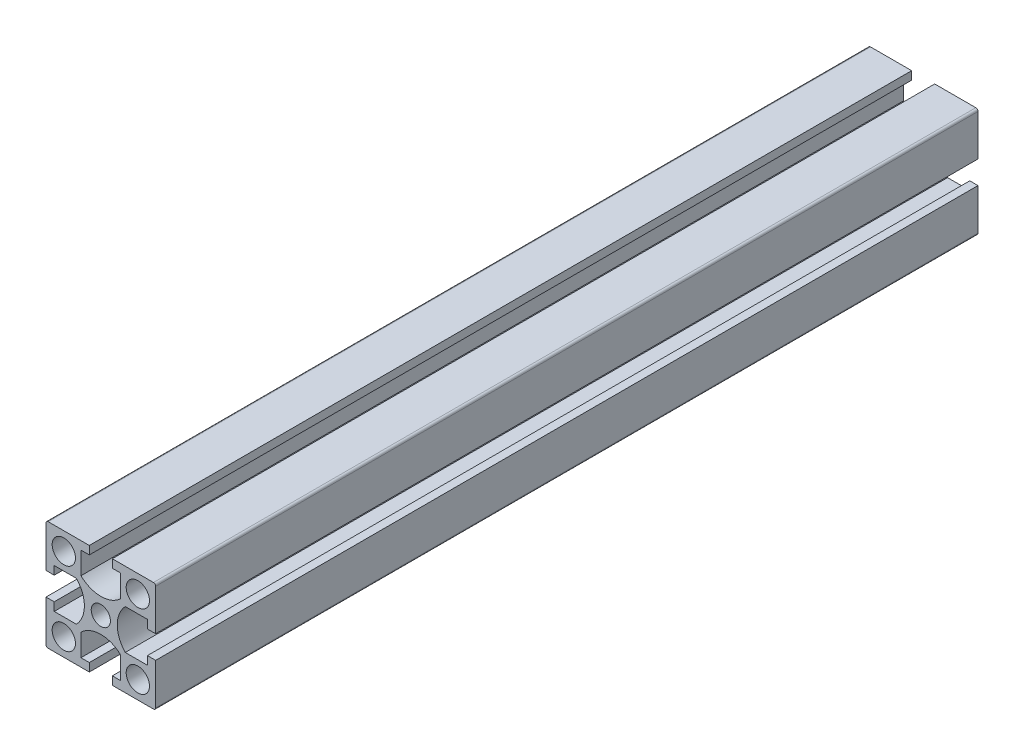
ISO-10303-21;
HEADER;
FILE_DESCRIPTION(('STEP AP214'),'2;1');
FILE_NAME('part.step','',(''),(''),'','','');
FILE_SCHEMA(('AUTOMOTIVE_DESIGN { 1 0 10303 214 1 1 1 1 }'));
ENDSEC;
DATA;
#1=APPLICATION_CONTEXT('core data for automotive mechanical design processes');
#2=APPLICATION_PROTOCOL_DEFINITION('international standard','automotive_design',2000,#1);
#3=PRODUCT_CONTEXT('',#1,'mechanical');
#4=PRODUCT('Part','Part','',(#3));
#5=PRODUCT_RELATED_PRODUCT_CATEGORY('part','',(#4));
#6=PRODUCT_DEFINITION_FORMATION('','',#4);
#7=PRODUCT_DEFINITION_CONTEXT('part definition',#1,'design');
#8=PRODUCT_DEFINITION('design','',#6,#7);
#9=PRODUCT_DEFINITION_SHAPE('','',#8);
#10=(LENGTH_UNIT() NAMED_UNIT(*) SI_UNIT(.MILLI.,.METRE.));
#11=(NAMED_UNIT(*) PLANE_ANGLE_UNIT() SI_UNIT($,.RADIAN.));
#12=(NAMED_UNIT(*) SI_UNIT($,.STERADIAN.) SOLID_ANGLE_UNIT());
#13=UNCERTAINTY_MEASURE_WITH_UNIT(LENGTH_MEASURE(1.E-05),#10,'distance_accuracy_value','');
#14=(GEOMETRIC_REPRESENTATION_CONTEXT(3) GLOBAL_UNCERTAINTY_ASSIGNED_CONTEXT((#13)) GLOBAL_UNIT_ASSIGNED_CONTEXT((#10,
#11,#12)) REPRESENTATION_CONTEXT('',''));
#15=CARTESIAN_POINT('',(0.,0.,0.));
#16=DIRECTION('',(0.,0.,1.));
#17=DIRECTION('',(1.,0.,0.));
#18=AXIS2_PLACEMENT_3D('',#15,#16,#17);
#19=CARTESIAN_POINT('',(-16.4999999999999,2.42861286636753E-13,150.));
#20=DIRECTION('',(0.,0.,1.));
#21=DIRECTION('',(1.,0.,0.));
#22=AXIS2_PLACEMENT_3D('',#19,#20,#21);
#23=PLANE('',#22);
#24=CARTESIAN_POINT('',(0.,0.,150.));
#25=DIRECTION('',(0.,0.,1.));
#26=DIRECTION('',(1.,0.,0.));
#27=AXIS2_PLACEMENT_3D('',#24,#25,#26);
#28=CIRCLE('',#27,3.5);
#29=CARTESIAN_POINT('',(3.5,0.,150.));
#30=VERTEX_POINT('',#29);
#31=EDGE_CURVE('E662',#30,#30,#28,.T.);
#32=ORIENTED_EDGE('',*,*,#31,.F.);
#33=EDGE_LOOP('',(#32));
#34=FACE_BOUND('',#33,.T.);
#35=CARTESIAN_POINT('',(13.5,-13.5,150.));
#36=DIRECTION('',(0.,0.,1.));
#37=DIRECTION('',(1.,0.,0.));
#38=AXIS2_PLACEMENT_3D('',#35,#36,#37);
#39=CIRCLE('',#38,4.25);
#40=CARTESIAN_POINT('',(17.75,-13.5,150.));
#41=VERTEX_POINT('',#40);
#42=EDGE_CURVE('E674',#41,#41,#39,.T.);
#43=ORIENTED_EDGE('',*,*,#42,.F.);
#44=EDGE_LOOP('',(#43));
#45=FACE_BOUND('',#44,.T.);
#46=DIRECTION('',(0.,1.,0.));
#47=VECTOR('',#46,1.);
#48=CARTESIAN_POINT('',(-17.,4.20000000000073,150.));
#49=LINE('',#48,#47);
#50=CARTESIAN_POINT('',(-17.,4.20000000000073,150.));
#51=VERTEX_POINT('',#50);
#52=CARTESIAN_POINT('',(-17.,7.25,150.));
#53=VERTEX_POINT('',#52);
#54=EDGE_CURVE('E403',#51,#53,#49,.T.);
#55=ORIENTED_EDGE('',*,*,#54,.T.);
#56=DIRECTION('',(1.,0.,0.));
#57=VECTOR('',#56,1.);
#58=CARTESIAN_POINT('',(-17.,7.25,150.));
#59=LINE('',#58,#57);
#60=CARTESIAN_POINT('',(-8.90477123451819,7.25,150.));
#61=VERTEX_POINT('',#60);
#62=EDGE_CURVE('E191',#53,#61,#59,.T.);
#63=ORIENTED_EDGE('',*,*,#62,.T.);
#64=CARTESIAN_POINT('',(-16.4999999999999,2.42861286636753E-13,150.));
#65=DIRECTION('',(0.,0.,-1.));
#66=DIRECTION('',(1.,0.,0.));
#67=AXIS2_PLACEMENT_3D('',#64,#65,#66);
#68=CIRCLE('',#67,10.4999999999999);
#69=CARTESIAN_POINT('',(-8.90477123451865,-7.25,150.));
#70=VERTEX_POINT('',#69);
#71=EDGE_CURVE('E514',#61,#70,#68,.T.);
#72=ORIENTED_EDGE('',*,*,#71,.T.);
#73=DIRECTION('',(-1.,0.,0.));
#74=VECTOR('',#73,1.);
#75=CARTESIAN_POINT('',(-8.90477123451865,-7.25,150.));
#76=LINE('',#75,#74);
#77=CARTESIAN_POINT('',(-17.,-7.25,150.));
#78=VERTEX_POINT('',#77);
#79=EDGE_CURVE('E533',#70,#78,#76,.T.);
#80=ORIENTED_EDGE('',*,*,#79,.T.);
#81=DIRECTION('',(0.,1.,0.));
#82=VECTOR('',#81,1.);
#83=CARTESIAN_POINT('',(-17.,-7.25,150.));
#84=LINE('',#83,#82);
#85=CARTESIAN_POINT('',(-17.,-4.19999999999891,150.));
#86=VERTEX_POINT('',#85);
#87=EDGE_CURVE('E530',#78,#86,#84,.T.);
#88=ORIENTED_EDGE('',*,*,#87,.T.);
#89=DIRECTION('',(-1.,0.,0.));
#90=VECTOR('',#89,1.);
#91=CARTESIAN_POINT('',(-17.,-4.19999999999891,150.));
#92=LINE('',#91,#90);
#93=CARTESIAN_POINT('',(-20.,-4.19999999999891,150.));
#94=VERTEX_POINT('',#93);
#95=EDGE_CURVE('E532',#86,#94,#92,.T.);
#96=ORIENTED_EDGE('',*,*,#95,.T.);
#97=DIRECTION('',(0.,-1.,0.));
#98=VECTOR('',#97,1.);
#99=CARTESIAN_POINT('',(-20.,-4.19999999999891,150.));
#100=LINE('',#99,#98);
#101=CARTESIAN_POINT('',(-20.,-19.1999999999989,150.));
#102=VERTEX_POINT('',#101);
#103=EDGE_CURVE('E535',#94,#102,#100,.T.);
#104=ORIENTED_EDGE('',*,*,#103,.T.);
#105=CARTESIAN_POINT('',(-19.1999999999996,-19.1999999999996,150.));
#106=DIRECTION('',(0.,0.,1.));
#107=DIRECTION('',(1.,0.,0.));
#108=AXIS2_PLACEMENT_3D('',#105,#106,#107);
#109=CIRCLE('',#108,0.800000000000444);
#110=CARTESIAN_POINT('',(-19.2000000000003,-20.,150.));
#111=VERTEX_POINT('',#110);
#112=EDGE_CURVE('E541',#102,#111,#109,.T.);
#113=ORIENTED_EDGE('',*,*,#112,.T.);
#114=DIRECTION('',(1.,0.,0.));
#115=VECTOR('',#114,1.);
#116=CARTESIAN_POINT('',(-19.2000000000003,-20.,150.));
#117=LINE('',#116,#115);
#118=CARTESIAN_POINT('',(-4.20000000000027,-20.,150.));
#119=VERTEX_POINT('',#118);
#120=EDGE_CURVE('E543',#111,#119,#117,.T.);
#121=ORIENTED_EDGE('',*,*,#120,.T.);
#122=DIRECTION('',(0.,1.,0.));
#123=VECTOR('',#122,1.);
#124=CARTESIAN_POINT('',(-4.20000000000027,-20.,150.));
#125=LINE('',#124,#123);
#126=CARTESIAN_POINT('',(-4.20000000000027,-17.,150.));
#127=VERTEX_POINT('',#126);
#128=EDGE_CURVE('E545',#119,#127,#125,.T.);
#129=ORIENTED_EDGE('',*,*,#128,.T.);
#130=DIRECTION('',(-1.,0.,0.));
#131=VECTOR('',#130,1.);
#132=CARTESIAN_POINT('',(-4.20000000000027,-17.,150.));
#133=LINE('',#132,#131);
#134=CARTESIAN_POINT('',(-7.25,-17.,150.));
#135=VERTEX_POINT('',#134);
#136=EDGE_CURVE('E547',#127,#135,#133,.T.);
#137=ORIENTED_EDGE('',*,*,#136,.T.);
#138=DIRECTION('',(0.,1.,0.));
#139=VECTOR('',#138,1.);
#140=CARTESIAN_POINT('',(-7.25,-17.,150.));
#141=LINE('',#140,#139);
#142=CARTESIAN_POINT('',(-7.25,-8.90477123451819,150.));
#143=VERTEX_POINT('',#142);
#144=EDGE_CURVE('E549',#135,#143,#141,.T.);
#145=ORIENTED_EDGE('',*,*,#144,.T.);
#146=CARTESIAN_POINT('',(0.,-16.5000000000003,150.));
#147=DIRECTION('',(0.,0.,-1.));
#148=DIRECTION('',(1.,0.,0.));
#149=AXIS2_PLACEMENT_3D('',#146,#147,#148);
#150=CIRCLE('',#149,10.5000000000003);
#151=CARTESIAN_POINT('',(7.25,-8.9047712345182,150.));
#152=VERTEX_POINT('',#151);
#153=EDGE_CURVE('E551',#143,#152,#150,.T.);
#154=ORIENTED_EDGE('',*,*,#153,.T.);
#155=DIRECTION('',(0.,-1.,0.));
#156=VECTOR('',#155,1.);
#157=CARTESIAN_POINT('',(7.25000000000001,-8.90477123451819,150.));
#158=LINE('',#157,#156);
#159=CARTESIAN_POINT('',(7.25000000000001,-17.,150.));
#160=VERTEX_POINT('',#159);
#161=EDGE_CURVE('E553',#152,#160,#158,.T.);
#162=ORIENTED_EDGE('',*,*,#161,.T.);
#163=DIRECTION('',(-1.,0.,0.));
#164=VECTOR('',#163,1.);
#165=CARTESIAN_POINT('',(7.25000000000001,-17.,150.));
#166=LINE('',#165,#164);
#167=CARTESIAN_POINT('',(4.19999999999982,-17.,150.));
#168=VERTEX_POINT('',#167);
#169=EDGE_CURVE('E555',#160,#168,#166,.T.);
#170=ORIENTED_EDGE('',*,*,#169,.T.);
#171=DIRECTION('',(0.,-1.,0.));
#172=VECTOR('',#171,1.);
#173=CARTESIAN_POINT('',(4.19999999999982,-17.,150.));
#174=LINE('',#173,#172);
#175=CARTESIAN_POINT('',(4.19999999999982,-20.,150.));
#176=VERTEX_POINT('',#175);
#177=EDGE_CURVE('E557',#168,#176,#174,.T.);
#178=ORIENTED_EDGE('',*,*,#177,.T.);
#179=DIRECTION('',(1.,0.,0.));
#180=VECTOR('',#179,1.);
#181=CARTESIAN_POINT('',(4.19999999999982,-20.,150.));
#182=LINE('',#181,#180);
#183=CARTESIAN_POINT('',(19.1999999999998,-20.,150.));
#184=VERTEX_POINT('',#183);
#185=EDGE_CURVE('E559',#176,#184,#182,.T.);
#186=ORIENTED_EDGE('',*,*,#185,.T.);
#187=CARTESIAN_POINT('',(19.1999999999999,-19.2000000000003,150.));
#188=DIRECTION('',(0.,0.,1.));
#189=DIRECTION('',(1.,0.,0.));
#190=AXIS2_PLACEMENT_3D('',#187,#188,#189);
#191=CIRCLE('',#190,0.799999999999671);
#192=CARTESIAN_POINT('',(19.9999999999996,-19.1999999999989,150.));
#193=VERTEX_POINT('',#192);
#194=EDGE_CURVE('E561',#184,#193,#191,.T.);
#195=ORIENTED_EDGE('',*,*,#194,.T.);
#196=DIRECTION('',(0.,1.,0.));
#197=VECTOR('',#196,1.);
#198=CARTESIAN_POINT('',(19.9999999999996,-19.1999999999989,150.));
#199=LINE('',#198,#197);
#200=CARTESIAN_POINT('',(20.,-4.19999999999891,150.));
#201=VERTEX_POINT('',#200);
#202=EDGE_CURVE('E563',#193,#201,#199,.T.);
#203=ORIENTED_EDGE('',*,*,#202,.T.);
#204=DIRECTION('',(-1.,0.,0.));
#205=VECTOR('',#204,1.);
#206=CARTESIAN_POINT('',(20.,-4.19999999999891,150.));
#207=LINE('',#206,#205);
#208=CARTESIAN_POINT('',(16.9999999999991,-4.19999999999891,150.));
#209=VERTEX_POINT('',#208);
#210=EDGE_CURVE('E565',#201,#209,#207,.T.);
#211=ORIENTED_EDGE('',*,*,#210,.T.);
#212=DIRECTION('',(0.,-1.,0.));
#213=VECTOR('',#212,1.);
#214=CARTESIAN_POINT('',(16.9999999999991,-4.19999999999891,150.));
#215=LINE('',#214,#213);
#216=CARTESIAN_POINT('',(16.9999999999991,-7.25,150.));
#217=VERTEX_POINT('',#216);
#218=EDGE_CURVE('E567',#209,#217,#215,.T.);
#219=ORIENTED_EDGE('',*,*,#218,.T.);
#220=DIRECTION('',(-1.,0.,0.));
#221=VECTOR('',#220,1.);
#222=CARTESIAN_POINT('',(16.9999999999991,-7.25,150.));
#223=LINE('',#222,#221);
#224=CARTESIAN_POINT('',(8.9047712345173,-7.25,150.));
#225=VERTEX_POINT('',#224);
#226=EDGE_CURVE('E569',#217,#225,#223,.T.);
#227=ORIENTED_EDGE('',*,*,#226,.T.);
#228=CARTESIAN_POINT('',(16.4999999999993,0.,150.));
#229=DIRECTION('',(0.,0.,-1.));
#230=DIRECTION('',(1.,0.,0.));
#231=AXIS2_PLACEMENT_3D('',#228,#229,#230);
#232=CIRCLE('',#231,10.5000000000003);
#233=CARTESIAN_POINT('',(8.9047712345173,7.25,150.));
#234=VERTEX_POINT('',#233);
#235=EDGE_CURVE('E571',#225,#234,#232,.T.);
#236=ORIENTED_EDGE('',*,*,#235,.T.);
#237=DIRECTION('',(1.,0.,0.));
#238=VECTOR('',#237,1.);
#239=CARTESIAN_POINT('',(8.9047712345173,7.25,150.));
#240=LINE('',#239,#238);
#241=CARTESIAN_POINT('',(16.9999999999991,7.25,150.));
#242=VERTEX_POINT('',#241);
#243=EDGE_CURVE('E573',#234,#242,#240,.T.);
#244=ORIENTED_EDGE('',*,*,#243,.T.);
#245=DIRECTION('',(0.,-1.,0.));
#246=VECTOR('',#245,1.);
#247=CARTESIAN_POINT('',(16.9999999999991,7.25,150.));
#248=LINE('',#247,#246);
#249=CARTESIAN_POINT('',(16.9999999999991,4.20000000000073,150.));
#250=VERTEX_POINT('',#249);
#251=EDGE_CURVE('E575',#242,#250,#248,.T.);
#252=ORIENTED_EDGE('',*,*,#251,.T.);
#253=DIRECTION('',(1.,0.,0.));
#254=VECTOR('',#253,1.);
#255=CARTESIAN_POINT('',(16.9999999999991,4.20000000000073,150.));
#256=LINE('',#255,#254);
#257=CARTESIAN_POINT('',(20.,4.20000000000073,150.));
#258=VERTEX_POINT('',#257);
#259=EDGE_CURVE('E577',#250,#258,#256,.T.);
#260=ORIENTED_EDGE('',*,*,#259,.T.);
#261=DIRECTION('',(0.,1.,0.));
#262=VECTOR('',#261,1.);
#263=CARTESIAN_POINT('',(20.,4.20000000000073,150.));
#264=LINE('',#263,#262);
#265=CARTESIAN_POINT('',(20.,19.2000000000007,150.));
#266=VERTEX_POINT('',#265);
#267=EDGE_CURVE('E579',#258,#266,#264,.T.);
#268=ORIENTED_EDGE('',*,*,#267,.T.);
#269=CARTESIAN_POINT('',(19.2000000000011,19.2000000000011,150.));
#270=DIRECTION('',(0.,0.,1.));
#271=DIRECTION('',(1.,0.,0.));
#272=AXIS2_PLACEMENT_3D('',#269,#270,#271);
#273=CIRCLE('',#272,0.799999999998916);
#274=CARTESIAN_POINT('',(19.1999999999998,20.,150.));
#275=VERTEX_POINT('',#274);
#276=EDGE_CURVE('E581',#266,#275,#273,.T.);
#277=ORIENTED_EDGE('',*,*,#276,.T.);
#278=DIRECTION('',(-1.,0.,0.));
#279=VECTOR('',#278,1.);
#280=CARTESIAN_POINT('',(19.1999999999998,20.,150.));
#281=LINE('',#280,#279);
#282=CARTESIAN_POINT('',(4.19999999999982,20.,150.));
#283=VERTEX_POINT('',#282);
#284=EDGE_CURVE('E583',#275,#283,#281,.T.);
#285=ORIENTED_EDGE('',*,*,#284,.T.);
#286=DIRECTION('',(0.,-1.,0.));
#287=VECTOR('',#286,1.);
#288=CARTESIAN_POINT('',(4.19999999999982,20.,150.));
#289=LINE('',#288,#287);
#290=CARTESIAN_POINT('',(4.19999999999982,17.,150.));
#291=VERTEX_POINT('',#290);
#292=EDGE_CURVE('E585',#283,#291,#289,.T.);
#293=ORIENTED_EDGE('',*,*,#292,.T.);
#294=DIRECTION('',(1.,0.,0.));
#295=VECTOR('',#294,1.);
#296=CARTESIAN_POINT('',(4.19999999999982,17.,150.));
#297=LINE('',#296,#295);
#298=CARTESIAN_POINT('',(7.25000000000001,17.,150.));
#299=VERTEX_POINT('',#298);
#300=EDGE_CURVE('E587',#291,#299,#297,.T.);
#301=ORIENTED_EDGE('',*,*,#300,.T.);
#302=DIRECTION('',(0.,-1.,0.));
#303=VECTOR('',#302,1.);
#304=CARTESIAN_POINT('',(7.25000000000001,17.,150.));
#305=LINE('',#304,#303);
#306=CARTESIAN_POINT('',(7.25000000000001,8.9047712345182,150.));
#307=VERTEX_POINT('',#306);
#308=EDGE_CURVE('E589',#299,#307,#305,.T.);
#309=ORIENTED_EDGE('',*,*,#308,.T.);
#310=CARTESIAN_POINT('',(0.,16.5000000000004,150.));
#311=DIRECTION('',(0.,0.,-1.));
#312=DIRECTION('',(1.,0.,0.));
#313=AXIS2_PLACEMENT_3D('',#310,#311,#312);
#314=CIRCLE('',#313,10.5000000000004);
#315=CARTESIAN_POINT('',(-7.24999999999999,8.9047712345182,150.));
#316=VERTEX_POINT('',#315);
#317=EDGE_CURVE('E591',#307,#316,#314,.T.);
#318=ORIENTED_EDGE('',*,*,#317,.T.);
#319=DIRECTION('',(0.,1.,0.));
#320=VECTOR('',#319,1.);
#321=CARTESIAN_POINT('',(-7.24999999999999,8.9047712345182,150.));
#322=LINE('',#321,#320);
#323=CARTESIAN_POINT('',(-7.25,17.,150.));
#324=VERTEX_POINT('',#323);
#325=EDGE_CURVE('E593',#316,#324,#322,.T.);
#326=ORIENTED_EDGE('',*,*,#325,.T.);
#327=DIRECTION('',(1.,0.,0.));
#328=VECTOR('',#327,1.);
#329=CARTESIAN_POINT('',(-7.25,17.,150.));
#330=LINE('',#329,#328);
#331=CARTESIAN_POINT('',(-4.20000000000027,17.,150.));
#332=VERTEX_POINT('',#331);
#333=EDGE_CURVE('E595',#324,#332,#330,.T.);
#334=ORIENTED_EDGE('',*,*,#333,.T.);
#335=DIRECTION('',(0.,1.,0.));
#336=VECTOR('',#335,1.);
#337=CARTESIAN_POINT('',(-4.20000000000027,17.,150.));
#338=LINE('',#337,#336);
#339=CARTESIAN_POINT('',(-4.20000000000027,20.,150.));
#340=VERTEX_POINT('',#339);
#341=EDGE_CURVE('E597',#332,#340,#338,.T.);
#342=ORIENTED_EDGE('',*,*,#341,.T.);
#343=DIRECTION('',(-1.,0.,0.));
#344=VECTOR('',#343,1.);
#345=CARTESIAN_POINT('',(-4.20000000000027,20.,150.));
#346=LINE('',#345,#344);
#347=CARTESIAN_POINT('',(-19.2000000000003,20.,150.));
#348=VERTEX_POINT('',#347);
#349=EDGE_CURVE('E306',#340,#348,#346,.T.);
#350=ORIENTED_EDGE('',*,*,#349,.T.);
#351=CARTESIAN_POINT('',(-19.2000000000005,19.2000000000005,150.));
#352=DIRECTION('',(0.,0.,1.));
#353=DIRECTION('',(1.,0.,0.));
#354=AXIS2_PLACEMENT_3D('',#351,#352,#353);
#355=CIRCLE('',#354,0.799999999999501);
#356=CARTESIAN_POINT('',(-20.,19.2000000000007,150.));
#357=VERTEX_POINT('',#356);
#358=EDGE_CURVE('E300',#348,#357,#355,.T.);
#359=ORIENTED_EDGE('',*,*,#358,.T.);
#360=DIRECTION('',(0.,-1.,0.));
#361=VECTOR('',#360,1.);
#362=CARTESIAN_POINT('',(-20.,19.2000000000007,150.));
#363=LINE('',#362,#361);
#364=CARTESIAN_POINT('',(-20.,4.20000000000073,150.));
#365=VERTEX_POINT('',#364);
#366=EDGE_CURVE('E304',#357,#365,#363,.T.);
#367=ORIENTED_EDGE('',*,*,#366,.T.);
#368=DIRECTION('',(1.,0.,0.));
#369=VECTOR('',#368,1.);
#370=CARTESIAN_POINT('',(-20.,4.20000000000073,150.));
#371=LINE('',#370,#369);
#372=EDGE_CURVE('E52',#365,#51,#371,.T.);
#373=ORIENTED_EDGE('',*,*,#372,.T.);
#374=EDGE_LOOP('',(#55,#63,#72,#80,#88,#96,#104,#113,#121,#129,#137,#145,#154,#162,#170,#178,
#186,#195,#203,#211,#219,#227,#236,#244,#252,#260,#268,#277,#285,#293,#301,#309,#318,#326,#334,
#342,#350,#359,#367,#373));
#375=FACE_BOUND('',#374,.T.);
#376=CARTESIAN_POINT('',(-13.5,-13.5,150.));
#377=DIRECTION('',(0.,0.,1.));
#378=DIRECTION('',(1.,0.,0.));
#379=AXIS2_PLACEMENT_3D('',#376,#377,#378);
#380=CIRCLE('',#379,4.25);
#381=CARTESIAN_POINT('',(-9.24999999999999,-13.5,150.));
#382=VERTEX_POINT('',#381);
#383=EDGE_CURVE('E328',#382,#382,#380,.T.);
#384=ORIENTED_EDGE('',*,*,#383,.F.);
#385=EDGE_LOOP('',(#384));
#386=FACE_BOUND('',#385,.T.);
#387=CARTESIAN_POINT('',(-13.5,13.5,150.));
#388=DIRECTION('',(0.,0.,1.));
#389=DIRECTION('',(1.,0.,0.));
#390=AXIS2_PLACEMENT_3D('',#387,#388,#389);
#391=CIRCLE('',#390,4.25);
#392=CARTESIAN_POINT('',(-9.24999999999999,13.5,150.));
#393=VERTEX_POINT('',#392);
#394=EDGE_CURVE('E668',#393,#393,#391,.T.);
#395=ORIENTED_EDGE('',*,*,#394,.F.);
#396=EDGE_LOOP('',(#395));
#397=FACE_BOUND('',#396,.T.);
#398=CARTESIAN_POINT('',(13.5,13.5,150.));
#399=DIRECTION('',(0.,0.,1.));
#400=DIRECTION('',(1.,0.,0.));
#401=AXIS2_PLACEMENT_3D('',#398,#399,#400);
#402=CIRCLE('',#401,4.25);
#403=CARTESIAN_POINT('',(17.75,13.5,150.));
#404=VERTEX_POINT('',#403);
#405=EDGE_CURVE('E653',#404,#404,#402,.T.);
#406=ORIENTED_EDGE('',*,*,#405,.F.);
#407=EDGE_LOOP('',(#406));
#408=FACE_BOUND('',#407,.T.);
#409=ADVANCED_FACE('F35',(#34,#45,#375,#386,#397,#408),#23,.T.);
#410=CARTESIAN_POINT('',(-16.4999999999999,2.42861286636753E-13,-150.));
#411=DIRECTION('',(0.,0.,1.));
#412=DIRECTION('',(1.,0.,0.));
#413=AXIS2_PLACEMENT_3D('',#410,#411,#412);
#414=PLANE('',#413);
#415=CARTESIAN_POINT('',(0.,0.,-150.));
#416=DIRECTION('',(0.,0.,1.));
#417=DIRECTION('',(1.,0.,0.));
#418=AXIS2_PLACEMENT_3D('',#415,#416,#417);
#419=CIRCLE('',#418,3.5);
#420=CARTESIAN_POINT('',(3.5,0.,-150.));
#421=VERTEX_POINT('',#420);
#422=EDGE_CURVE('E659',#421,#421,#419,.T.);
#423=ORIENTED_EDGE('',*,*,#422,.T.);
#424=EDGE_LOOP('',(#423));
#425=FACE_BOUND('',#424,.T.);
#426=CARTESIAN_POINT('',(13.5,-13.5,-150.));
#427=DIRECTION('',(0.,0.,1.));
#428=DIRECTION('',(1.,0.,0.));
#429=AXIS2_PLACEMENT_3D('',#426,#427,#428);
#430=CIRCLE('',#429,4.25);
#431=CARTESIAN_POINT('',(17.75,-13.5,-150.));
#432=VERTEX_POINT('',#431);
#433=EDGE_CURVE('E671',#432,#432,#430,.T.);
#434=ORIENTED_EDGE('',*,*,#433,.T.);
#435=EDGE_LOOP('',(#434));
#436=FACE_BOUND('',#435,.T.);
#437=DIRECTION('',(0.,1.,0.));
#438=VECTOR('',#437,1.);
#439=CARTESIAN_POINT('',(-17.,4.20000000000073,-150.));
#440=LINE('',#439,#438);
#441=CARTESIAN_POINT('',(-17.,4.20000000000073,-150.));
#442=VERTEX_POINT('',#441);
#443=CARTESIAN_POINT('',(-17.,7.25,-150.));
#444=VERTEX_POINT('',#443);
#445=EDGE_CURVE('E324',#442,#444,#440,.T.);
#446=ORIENTED_EDGE('',*,*,#445,.F.);
#447=DIRECTION('',(1.,0.,0.));
#448=VECTOR('',#447,1.);
#449=CARTESIAN_POINT('',(-20.,4.20000000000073,-150.));
#450=LINE('',#449,#448);
#451=CARTESIAN_POINT('',(-20.,4.20000000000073,-150.));
#452=VERTEX_POINT('',#451);
#453=EDGE_CURVE('E183',#452,#442,#450,.T.);
#454=ORIENTED_EDGE('',*,*,#453,.F.);
#455=DIRECTION('',(0.,-1.,0.));
#456=VECTOR('',#455,1.);
#457=CARTESIAN_POINT('',(-20.,19.2000000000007,-150.));
#458=LINE('',#457,#456);
#459=CARTESIAN_POINT('',(-20.,19.2000000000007,-150.));
#460=VERTEX_POINT('',#459);
#461=EDGE_CURVE('E177',#460,#452,#458,.T.);
#462=ORIENTED_EDGE('',*,*,#461,.F.);
#463=CARTESIAN_POINT('',(-19.2000000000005,19.2000000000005,-150.));
#464=DIRECTION('',(0.,0.,1.));
#465=DIRECTION('',(1.,0.,0.));
#466=AXIS2_PLACEMENT_3D('',#463,#464,#465);
#467=CIRCLE('',#466,0.799999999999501);
#468=CARTESIAN_POINT('',(-19.2000000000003,20.,-150.));
#469=VERTEX_POINT('',#468);
#470=EDGE_CURVE('E314',#469,#460,#467,.T.);
#471=ORIENTED_EDGE('',*,*,#470,.F.);
#472=DIRECTION('',(-1.,0.,0.));
#473=VECTOR('',#472,1.);
#474=CARTESIAN_POINT('',(-4.20000000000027,20.,-150.));
#475=LINE('',#474,#473);
#476=CARTESIAN_POINT('',(-4.20000000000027,20.,-150.));
#477=VERTEX_POINT('',#476);
#478=EDGE_CURVE('E398',#477,#469,#475,.T.);
#479=ORIENTED_EDGE('',*,*,#478,.F.);
#480=DIRECTION('',(0.,1.,0.));
#481=VECTOR('',#480,1.);
#482=CARTESIAN_POINT('',(-4.20000000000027,17.,-150.));
#483=LINE('',#482,#481);
#484=CARTESIAN_POINT('',(-4.20000000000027,17.,-150.));
#485=VERTEX_POINT('',#484);
#486=EDGE_CURVE('E396',#485,#477,#483,.T.);
#487=ORIENTED_EDGE('',*,*,#486,.F.);
#488=DIRECTION('',(1.,0.,0.));
#489=VECTOR('',#488,1.);
#490=CARTESIAN_POINT('',(-7.25,17.,-150.));
#491=LINE('',#490,#489);
#492=CARTESIAN_POINT('',(-7.25,17.,-150.));
#493=VERTEX_POINT('',#492);
#494=EDGE_CURVE('E394',#493,#485,#491,.T.);
#495=ORIENTED_EDGE('',*,*,#494,.F.);
#496=DIRECTION('',(0.,1.,0.));
#497=VECTOR('',#496,1.);
#498=CARTESIAN_POINT('',(-7.24999999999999,8.9047712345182,-150.));
#499=LINE('',#498,#497);
#500=CARTESIAN_POINT('',(-7.24999999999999,8.9047712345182,-150.));
#501=VERTEX_POINT('',#500);
#502=EDGE_CURVE('E392',#501,#493,#499,.T.);
#503=ORIENTED_EDGE('',*,*,#502,.F.);
#504=CARTESIAN_POINT('',(0.,16.5000000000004,-150.));
#505=DIRECTION('',(0.,0.,-1.));
#506=DIRECTION('',(1.,0.,0.));
#507=AXIS2_PLACEMENT_3D('',#504,#505,#506);
#508=CIRCLE('',#507,10.5000000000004);
#509=CARTESIAN_POINT('',(7.25000000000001,8.9047712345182,-150.));
#510=VERTEX_POINT('',#509);
#511=EDGE_CURVE('E390',#510,#501,#508,.T.);
#512=ORIENTED_EDGE('',*,*,#511,.F.);
#513=DIRECTION('',(0.,-1.,0.));
#514=VECTOR('',#513,1.);
#515=CARTESIAN_POINT('',(7.25000000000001,17.,-150.));
#516=LINE('',#515,#514);
#517=CARTESIAN_POINT('',(7.25000000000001,17.,-150.));
#518=VERTEX_POINT('',#517);
#519=EDGE_CURVE('E388',#518,#510,#516,.T.);
#520=ORIENTED_EDGE('',*,*,#519,.F.);
#521=DIRECTION('',(1.,0.,0.));
#522=VECTOR('',#521,1.);
#523=CARTESIAN_POINT('',(4.19999999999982,17.,-150.));
#524=LINE('',#523,#522);
#525=CARTESIAN_POINT('',(4.19999999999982,17.,-150.));
#526=VERTEX_POINT('',#525);
#527=EDGE_CURVE('E386',#526,#518,#524,.T.);
#528=ORIENTED_EDGE('',*,*,#527,.F.);
#529=DIRECTION('',(0.,-1.,0.));
#530=VECTOR('',#529,1.);
#531=CARTESIAN_POINT('',(4.19999999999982,20.,-150.));
#532=LINE('',#531,#530);
#533=CARTESIAN_POINT('',(4.19999999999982,20.,-150.));
#534=VERTEX_POINT('',#533);
#535=EDGE_CURVE('E384',#534,#526,#532,.T.);
#536=ORIENTED_EDGE('',*,*,#535,.F.);
#537=DIRECTION('',(-1.,0.,0.));
#538=VECTOR('',#537,1.);
#539=CARTESIAN_POINT('',(19.1999999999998,20.,-150.));
#540=LINE('',#539,#538);
#541=CARTESIAN_POINT('',(19.1999999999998,20.,-150.));
#542=VERTEX_POINT('',#541);
#543=EDGE_CURVE('E382',#542,#534,#540,.T.);
#544=ORIENTED_EDGE('',*,*,#543,.F.);
#545=CARTESIAN_POINT('',(19.2000000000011,19.2000000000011,-150.));
#546=DIRECTION('',(0.,0.,1.));
#547=DIRECTION('',(1.,0.,0.));
#548=AXIS2_PLACEMENT_3D('',#545,#546,#547);
#549=CIRCLE('',#548,0.799999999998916);
#550=CARTESIAN_POINT('',(20.,19.2000000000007,-150.));
#551=VERTEX_POINT('',#550);
#552=EDGE_CURVE('E380',#551,#542,#549,.T.);
#553=ORIENTED_EDGE('',*,*,#552,.F.);
#554=DIRECTION('',(0.,1.,0.));
#555=VECTOR('',#554,1.);
#556=CARTESIAN_POINT('',(20.,4.20000000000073,-150.));
#557=LINE('',#556,#555);
#558=CARTESIAN_POINT('',(20.,4.20000000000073,-150.));
#559=VERTEX_POINT('',#558);
#560=EDGE_CURVE('E378',#559,#551,#557,.T.);
#561=ORIENTED_EDGE('',*,*,#560,.F.);
#562=DIRECTION('',(1.,0.,0.));
#563=VECTOR('',#562,1.);
#564=CARTESIAN_POINT('',(16.9999999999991,4.20000000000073,-150.));
#565=LINE('',#564,#563);
#566=CARTESIAN_POINT('',(16.9999999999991,4.20000000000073,-150.));
#567=VERTEX_POINT('',#566);
#568=EDGE_CURVE('E376',#567,#559,#565,.T.);
#569=ORIENTED_EDGE('',*,*,#568,.F.);
#570=DIRECTION('',(0.,-1.,0.));
#571=VECTOR('',#570,1.);
#572=CARTESIAN_POINT('',(16.9999999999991,7.25,-150.));
#573=LINE('',#572,#571);
#574=CARTESIAN_POINT('',(16.9999999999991,7.25,-150.));
#575=VERTEX_POINT('',#574);
#576=EDGE_CURVE('E374',#575,#567,#573,.T.);
#577=ORIENTED_EDGE('',*,*,#576,.F.);
#578=DIRECTION('',(1.,0.,0.));
#579=VECTOR('',#578,1.);
#580=CARTESIAN_POINT('',(8.9047712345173,7.25,-150.));
#581=LINE('',#580,#579);
#582=CARTESIAN_POINT('',(8.9047712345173,7.25,-150.));
#583=VERTEX_POINT('',#582);
#584=EDGE_CURVE('E372',#583,#575,#581,.T.);
#585=ORIENTED_EDGE('',*,*,#584,.F.);
#586=CARTESIAN_POINT('',(16.4999999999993,0.,-150.));
#587=DIRECTION('',(0.,0.,-1.));
#588=DIRECTION('',(1.,0.,0.));
#589=AXIS2_PLACEMENT_3D('',#586,#587,#588);
#590=CIRCLE('',#589,10.5000000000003);
#591=CARTESIAN_POINT('',(8.9047712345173,-7.25,-150.));
#592=VERTEX_POINT('',#591);
#593=EDGE_CURVE('E370',#592,#583,#590,.T.);
#594=ORIENTED_EDGE('',*,*,#593,.F.);
#595=DIRECTION('',(-1.,0.,0.));
#596=VECTOR('',#595,1.);
#597=CARTESIAN_POINT('',(16.9999999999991,-7.25,-150.));
#598=LINE('',#597,#596);
#599=CARTESIAN_POINT('',(16.9999999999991,-7.25,-150.));
#600=VERTEX_POINT('',#599);
#601=EDGE_CURVE('E368',#600,#592,#598,.T.);
#602=ORIENTED_EDGE('',*,*,#601,.F.);
#603=DIRECTION('',(0.,-1.,0.));
#604=VECTOR('',#603,1.);
#605=CARTESIAN_POINT('',(16.9999999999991,-4.19999999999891,-150.));
#606=LINE('',#605,#604);
#607=CARTESIAN_POINT('',(16.9999999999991,-4.19999999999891,-150.));
#608=VERTEX_POINT('',#607);
#609=EDGE_CURVE('E366',#608,#600,#606,.T.);
#610=ORIENTED_EDGE('',*,*,#609,.F.);
#611=DIRECTION('',(-1.,0.,0.));
#612=VECTOR('',#611,1.);
#613=CARTESIAN_POINT('',(20.,-4.19999999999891,-150.));
#614=LINE('',#613,#612);
#615=CARTESIAN_POINT('',(20.,-4.19999999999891,-150.));
#616=VERTEX_POINT('',#615);
#617=EDGE_CURVE('E364',#616,#608,#614,.T.);
#618=ORIENTED_EDGE('',*,*,#617,.F.);
#619=DIRECTION('',(0.,1.,0.));
#620=VECTOR('',#619,1.);
#621=CARTESIAN_POINT('',(19.9999999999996,-19.1999999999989,-150.));
#622=LINE('',#621,#620);
#623=CARTESIAN_POINT('',(19.9999999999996,-19.1999999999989,-150.));
#624=VERTEX_POINT('',#623);
#625=EDGE_CURVE('E362',#624,#616,#622,.T.);
#626=ORIENTED_EDGE('',*,*,#625,.F.);
#627=CARTESIAN_POINT('',(19.1999999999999,-19.2000000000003,-150.));
#628=DIRECTION('',(0.,0.,1.));
#629=DIRECTION('',(1.,0.,0.));
#630=AXIS2_PLACEMENT_3D('',#627,#628,#629);
#631=CIRCLE('',#630,0.799999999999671);
#632=CARTESIAN_POINT('',(19.1999999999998,-20.,-150.));
#633=VERTEX_POINT('',#632);
#634=EDGE_CURVE('E360',#633,#624,#631,.T.);
#635=ORIENTED_EDGE('',*,*,#634,.F.);
#636=DIRECTION('',(1.,0.,0.));
#637=VECTOR('',#636,1.);
#638=CARTESIAN_POINT('',(4.19999999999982,-20.,-150.));
#639=LINE('',#638,#637);
#640=CARTESIAN_POINT('',(4.19999999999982,-20.,-150.));
#641=VERTEX_POINT('',#640);
#642=EDGE_CURVE('E358',#641,#633,#639,.T.);
#643=ORIENTED_EDGE('',*,*,#642,.F.);
#644=DIRECTION('',(0.,-1.,0.));
#645=VECTOR('',#644,1.);
#646=CARTESIAN_POINT('',(4.19999999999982,-17.,-150.));
#647=LINE('',#646,#645);
#648=CARTESIAN_POINT('',(4.19999999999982,-17.,-150.));
#649=VERTEX_POINT('',#648);
#650=EDGE_CURVE('E356',#649,#641,#647,.T.);
#651=ORIENTED_EDGE('',*,*,#650,.F.);
#652=DIRECTION('',(-1.,0.,0.));
#653=VECTOR('',#652,1.);
#654=CARTESIAN_POINT('',(7.25000000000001,-17.,-150.));
#655=LINE('',#654,#653);
#656=CARTESIAN_POINT('',(7.25000000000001,-17.,-150.));
#657=VERTEX_POINT('',#656);
#658=EDGE_CURVE('E354',#657,#649,#655,.T.);
#659=ORIENTED_EDGE('',*,*,#658,.F.);
#660=DIRECTION('',(0.,-1.,0.));
#661=VECTOR('',#660,1.);
#662=CARTESIAN_POINT('',(7.25000000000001,-8.90477123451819,-150.));
#663=LINE('',#662,#661);
#664=CARTESIAN_POINT('',(7.25,-8.9047712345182,-150.));
#665=VERTEX_POINT('',#664);
#666=EDGE_CURVE('E352',#665,#657,#663,.T.);
#667=ORIENTED_EDGE('',*,*,#666,.F.);
#668=CARTESIAN_POINT('',(0.,-16.5000000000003,-150.));
#669=DIRECTION('',(0.,0.,-1.));
#670=DIRECTION('',(1.,0.,0.));
#671=AXIS2_PLACEMENT_3D('',#668,#669,#670);
#672=CIRCLE('',#671,10.5000000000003);
#673=CARTESIAN_POINT('',(-7.25,-8.90477123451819,-150.));
#674=VERTEX_POINT('',#673);
#675=EDGE_CURVE('E350',#674,#665,#672,.T.);
#676=ORIENTED_EDGE('',*,*,#675,.F.);
#677=DIRECTION('',(0.,1.,0.));
#678=VECTOR('',#677,1.);
#679=CARTESIAN_POINT('',(-7.25,-17.,-150.));
#680=LINE('',#679,#678);
#681=CARTESIAN_POINT('',(-7.25,-17.,-150.));
#682=VERTEX_POINT('',#681);
#683=EDGE_CURVE('E348',#682,#674,#680,.T.);
#684=ORIENTED_EDGE('',*,*,#683,.F.);
#685=DIRECTION('',(-1.,0.,0.));
#686=VECTOR('',#685,1.);
#687=CARTESIAN_POINT('',(-4.20000000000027,-17.,-150.));
#688=LINE('',#687,#686);
#689=CARTESIAN_POINT('',(-4.20000000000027,-17.,-150.));
#690=VERTEX_POINT('',#689);
#691=EDGE_CURVE('E346',#690,#682,#688,.T.);
#692=ORIENTED_EDGE('',*,*,#691,.F.);
#693=DIRECTION('',(0.,1.,0.));
#694=VECTOR('',#693,1.);
#695=CARTESIAN_POINT('',(-4.20000000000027,-20.,-150.));
#696=LINE('',#695,#694);
#697=CARTESIAN_POINT('',(-4.20000000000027,-20.,-150.));
#698=VERTEX_POINT('',#697);
#699=EDGE_CURVE('E344',#698,#690,#696,.T.);
#700=ORIENTED_EDGE('',*,*,#699,.F.);
#701=DIRECTION('',(1.,0.,0.));
#702=VECTOR('',#701,1.);
#703=CARTESIAN_POINT('',(-19.2000000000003,-20.,-150.));
#704=LINE('',#703,#702);
#705=CARTESIAN_POINT('',(-19.2000000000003,-20.,-150.));
#706=VERTEX_POINT('',#705);
#707=EDGE_CURVE('E342',#706,#698,#704,.T.);
#708=ORIENTED_EDGE('',*,*,#707,.F.);
#709=CARTESIAN_POINT('',(-19.1999999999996,-19.1999999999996,-150.));
#710=DIRECTION('',(0.,0.,1.));
#711=DIRECTION('',(1.,0.,0.));
#712=AXIS2_PLACEMENT_3D('',#709,#710,#711);
#713=CIRCLE('',#712,0.800000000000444);
#714=CARTESIAN_POINT('',(-20.,-19.1999999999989,-150.));
#715=VERTEX_POINT('',#714);
#716=EDGE_CURVE('E340',#715,#706,#713,.T.);
#717=ORIENTED_EDGE('',*,*,#716,.F.);
#718=DIRECTION('',(0.,-1.,0.));
#719=VECTOR('',#718,1.);
#720=CARTESIAN_POINT('',(-20.,-4.19999999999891,-150.));
#721=LINE('',#720,#719);
#722=CARTESIAN_POINT('',(-20.,-4.19999999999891,-150.));
#723=VERTEX_POINT('',#722);
#724=EDGE_CURVE('E338',#723,#715,#721,.T.);
#725=ORIENTED_EDGE('',*,*,#724,.F.);
#726=DIRECTION('',(-1.,0.,0.));
#727=VECTOR('',#726,1.);
#728=CARTESIAN_POINT('',(-17.,-4.19999999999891,-150.));
#729=LINE('',#728,#727);
#730=CARTESIAN_POINT('',(-17.,-4.19999999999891,-150.));
#731=VERTEX_POINT('',#730);
#732=EDGE_CURVE('E336',#731,#723,#729,.T.);
#733=ORIENTED_EDGE('',*,*,#732,.F.);
#734=DIRECTION('',(0.,1.,0.));
#735=VECTOR('',#734,1.);
#736=CARTESIAN_POINT('',(-17.,-7.25,-150.));
#737=LINE('',#736,#735);
#738=CARTESIAN_POINT('',(-17.,-7.25,-150.));
#739=VERTEX_POINT('',#738);
#740=EDGE_CURVE('E334',#739,#731,#737,.T.);
#741=ORIENTED_EDGE('',*,*,#740,.F.);
#742=DIRECTION('',(-1.,0.,0.));
#743=VECTOR('',#742,1.);
#744=CARTESIAN_POINT('',(-8.90477123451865,-7.25,-150.));
#745=LINE('',#744,#743);
#746=CARTESIAN_POINT('',(-8.90477123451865,-7.25,-150.));
#747=VERTEX_POINT('',#746);
#748=EDGE_CURVE('E332',#747,#739,#745,.T.);
#749=ORIENTED_EDGE('',*,*,#748,.F.);
#750=CARTESIAN_POINT('',(-16.4999999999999,2.42861286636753E-13,-150.));
#751=DIRECTION('',(0.,0.,-1.));
#752=DIRECTION('',(1.,0.,0.));
#753=AXIS2_PLACEMENT_3D('',#750,#751,#752);
#754=CIRCLE('',#753,10.4999999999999);
#755=CARTESIAN_POINT('',(-8.90477123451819,7.25,-150.));
#756=VERTEX_POINT('',#755);
#757=EDGE_CURVE('E330',#756,#747,#754,.T.);
#758=ORIENTED_EDGE('',*,*,#757,.F.);
#759=DIRECTION('',(1.,0.,0.));
#760=VECTOR('',#759,1.);
#761=CARTESIAN_POINT('',(-17.,7.25,-150.));
#762=LINE('',#761,#760);
#763=EDGE_CURVE('E327',#444,#756,#762,.T.);
#764=ORIENTED_EDGE('',*,*,#763,.F.);
#765=EDGE_LOOP('',(#446,#454,#462,#471,#479,#487,#495,#503,#512,#520,#528,#536,#544,#553,#561,
#569,#577,#585,#594,#602,#610,#618,#626,#635,#643,#651,#659,#667,#676,#684,#692,#700,#708,#717,
#725,#733,#741,#749,#758,#764));
#766=FACE_BOUND('',#765,.T.);
#767=CARTESIAN_POINT('',(-13.5,-13.5,-150.));
#768=DIRECTION('',(0.,0.,1.));
#769=DIRECTION('',(1.,0.,0.));
#770=AXIS2_PLACEMENT_3D('',#767,#768,#769);
#771=CIRCLE('',#770,4.25);
#772=CARTESIAN_POINT('',(-9.24999999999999,-13.5,-150.));
#773=VERTEX_POINT('',#772);
#774=EDGE_CURVE('E677',#773,#773,#771,.T.);
#775=ORIENTED_EDGE('',*,*,#774,.T.);
#776=EDGE_LOOP('',(#775));
#777=FACE_BOUND('',#776,.T.);
#778=CARTESIAN_POINT('',(-13.5,13.5,-150.));
#779=DIRECTION('',(0.,0.,1.));
#780=DIRECTION('',(1.,0.,0.));
#781=AXIS2_PLACEMENT_3D('',#778,#779,#780);
#782=CIRCLE('',#781,4.25);
#783=CARTESIAN_POINT('',(-9.24999999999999,13.5,-150.));
#784=VERTEX_POINT('',#783);
#785=EDGE_CURVE('E665',#784,#784,#782,.T.);
#786=ORIENTED_EDGE('',*,*,#785,.T.);
#787=EDGE_LOOP('',(#786));
#788=FACE_BOUND('',#787,.T.);
#789=CARTESIAN_POINT('',(13.5,13.5,-150.));
#790=DIRECTION('',(0.,0.,1.));
#791=DIRECTION('',(1.,0.,0.));
#792=AXIS2_PLACEMENT_3D('',#789,#790,#791);
#793=CIRCLE('',#792,4.25);
#794=CARTESIAN_POINT('',(17.75,13.5,-150.));
#795=VERTEX_POINT('',#794);
#796=EDGE_CURVE('E656',#795,#795,#793,.T.);
#797=ORIENTED_EDGE('',*,*,#796,.T.);
#798=EDGE_LOOP('',(#797));
#799=FACE_BOUND('',#798,.T.);
#800=ADVANCED_FACE('F518',(#425,#436,#766,#777,#788,#799),#414,.F.);
#801=CARTESIAN_POINT('',(-17.,4.20000000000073,150.));
#802=DIRECTION('',(-1.,0.,0.));
#803=DIRECTION('',(0.,0.,1.));
#804=AXIS2_PLACEMENT_3D('',#801,#802,#803);
#805=PLANE('',#804);
#806=ORIENTED_EDGE('',*,*,#445,.T.);
#807=DIRECTION('',(0.,0.,-1.));
#808=VECTOR('',#807,1.);
#809=CARTESIAN_POINT('',(-17.,7.25,150.));
#810=LINE('',#809,#808);
#811=EDGE_CURVE('E11',#53,#444,#810,.T.);
#812=ORIENTED_EDGE('',*,*,#811,.F.);
#813=ORIENTED_EDGE('',*,*,#54,.F.);
#814=DIRECTION('',(0.,0.,-1.));
#815=VECTOR('',#814,1.);
#816=CARTESIAN_POINT('',(-17.,4.20000000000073,150.));
#817=LINE('',#816,#815);
#818=EDGE_CURVE('E320',#51,#442,#817,.T.);
#819=ORIENTED_EDGE('',*,*,#818,.T.);
#820=EDGE_LOOP('',(#806,#812,#813,#819));
#821=FACE_BOUND('',#820,.T.);
#822=ADVANCED_FACE('F37',(#821),#805,.F.);
#823=CARTESIAN_POINT('',(-17.,7.25,150.));
#824=DIRECTION('',(0.,1.,0.));
#825=DIRECTION('',(0.,0.,1.));
#826=AXIS2_PLACEMENT_3D('',#823,#824,#825);
#827=PLANE('',#826);
#828=ORIENTED_EDGE('',*,*,#763,.T.);
#829=DIRECTION('',(0.,0.,-1.));
#830=VECTOR('',#829,1.);
#831=CARTESIAN_POINT('',(-8.90477123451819,7.25,150.));
#832=LINE('',#831,#830);
#833=EDGE_CURVE('E44',#61,#756,#832,.T.);
#834=ORIENTED_EDGE('',*,*,#833,.F.);
#835=ORIENTED_EDGE('',*,*,#62,.F.);
#836=ORIENTED_EDGE('',*,*,#811,.T.);
#837=EDGE_LOOP('',(#828,#834,#835,#836));
#838=FACE_BOUND('',#837,.T.);
#839=ADVANCED_FACE('F1075',(#838),#827,.F.);
#840=CARTESIAN_POINT('',(-16.4999999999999,2.42861286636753E-13,150.));
#841=DIRECTION('',(0.,0.,-1.));
#842=DIRECTION('',(-1.,0.,0.));
#843=AXIS2_PLACEMENT_3D('',#840,#841,#842);
#844=CYLINDRICAL_SURFACE('',#843,10.4999999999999);
#845=ORIENTED_EDGE('',*,*,#757,.T.);
#846=DIRECTION('',(0.,0.,-1.));
#847=VECTOR('',#846,1.);
#848=CARTESIAN_POINT('',(-8.90477123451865,-7.25,150.));
#849=LINE('',#848,#847);
#850=EDGE_CURVE('E506',#70,#747,#849,.T.);
#851=ORIENTED_EDGE('',*,*,#850,.F.);
#852=ORIENTED_EDGE('',*,*,#71,.F.);
#853=ORIENTED_EDGE('',*,*,#833,.T.);
#854=EDGE_LOOP('',(#845,#851,#852,#853));
#855=FACE_BOUND('',#854,.T.);
#856=ADVANCED_FACE('F512',(#855),#844,.F.);
#857=CARTESIAN_POINT('',(-8.90477123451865,-7.25,150.));
#858=DIRECTION('',(0.,-1.,0.));
#859=DIRECTION('',(1.,0.,0.));
#860=AXIS2_PLACEMENT_3D('',#857,#858,#859);
#861=PLANE('',#860);
#862=ORIENTED_EDGE('',*,*,#748,.T.);
#863=DIRECTION('',(0.,0.,-1.));
#864=VECTOR('',#863,1.);
#865=CARTESIAN_POINT('',(-17.,-7.25,150.));
#866=LINE('',#865,#864);
#867=EDGE_CURVE('E503',#78,#739,#866,.T.);
#868=ORIENTED_EDGE('',*,*,#867,.F.);
#869=ORIENTED_EDGE('',*,*,#79,.F.);
#870=ORIENTED_EDGE('',*,*,#850,.T.);
#871=EDGE_LOOP('',(#862,#868,#869,#870));
#872=FACE_BOUND('',#871,.T.);
#873=ADVANCED_FACE('F524',(#872),#861,.F.);
#874=CARTESIAN_POINT('',(-17.,-7.25,150.));
#875=DIRECTION('',(-1.,0.,0.));
#876=DIRECTION('',(0.,0.,1.));
#877=AXIS2_PLACEMENT_3D('',#874,#875,#876);
#878=PLANE('',#877);
#879=ORIENTED_EDGE('',*,*,#740,.T.);
#880=DIRECTION('',(0.,0.,-1.));
#881=VECTOR('',#880,1.);
#882=CARTESIAN_POINT('',(-17.,-4.19999999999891,150.));
#883=LINE('',#882,#881);
#884=EDGE_CURVE('E500',#86,#731,#883,.T.);
#885=ORIENTED_EDGE('',*,*,#884,.F.);
#886=ORIENTED_EDGE('',*,*,#87,.F.);
#887=ORIENTED_EDGE('',*,*,#867,.T.);
#888=EDGE_LOOP('',(#879,#885,#886,#887));
#889=FACE_BOUND('',#888,.T.);
#890=ADVANCED_FACE('F528',(#889),#878,.F.);
#891=CARTESIAN_POINT('',(-17.,-4.19999999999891,150.));
#892=DIRECTION('',(0.,-1.,0.));
#893=DIRECTION('',(0.,0.,-1.));
#894=AXIS2_PLACEMENT_3D('',#891,#892,#893);
#895=PLANE('',#894);
#896=ORIENTED_EDGE('',*,*,#732,.T.);
#897=DIRECTION('',(0.,0.,-1.));
#898=VECTOR('',#897,1.);
#899=CARTESIAN_POINT('',(-20.,-4.19999999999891,150.));
#900=LINE('',#899,#898);
#901=EDGE_CURVE('E497',#94,#723,#900,.T.);
#902=ORIENTED_EDGE('',*,*,#901,.F.);
#903=ORIENTED_EDGE('',*,*,#95,.F.);
#904=ORIENTED_EDGE('',*,*,#884,.T.);
#905=EDGE_LOOP('',(#896,#902,#903,#904));
#906=FACE_BOUND('',#905,.T.);
#907=ADVANCED_FACE('F1040',(#906),#895,.F.);
#908=CARTESIAN_POINT('',(-20.,-4.19999999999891,150.));
#909=DIRECTION('',(1.,0.,0.));
#910=DIRECTION('',(0.,0.,-1.));
#911=AXIS2_PLACEMENT_3D('',#908,#909,#910);
#912=PLANE('',#911);
#913=ORIENTED_EDGE('',*,*,#724,.T.);
#914=DIRECTION('',(0.,0.,-1.));
#915=VECTOR('',#914,1.);
#916=CARTESIAN_POINT('',(-20.,-19.1999999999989,150.));
#917=LINE('',#916,#915);
#918=EDGE_CURVE('E494',#102,#715,#917,.T.);
#919=ORIENTED_EDGE('',*,*,#918,.F.);
#920=ORIENTED_EDGE('',*,*,#103,.F.);
#921=ORIENTED_EDGE('',*,*,#901,.T.);
#922=EDGE_LOOP('',(#913,#919,#920,#921));
#923=FACE_BOUND('',#922,.T.);
#924=ADVANCED_FACE('F1030',(#923),#912,.F.);
#925=CARTESIAN_POINT('',(-19.1999999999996,-19.1999999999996,150.));
#926=DIRECTION('',(0.,0.,-1.));
#927=DIRECTION('',(-1.,0.,0.));
#928=AXIS2_PLACEMENT_3D('',#925,#926,#927);
#929=CYLINDRICAL_SURFACE('',#928,0.800000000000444);
#930=ORIENTED_EDGE('',*,*,#716,.T.);
#931=DIRECTION('',(0.,0.,-1.));
#932=VECTOR('',#931,1.);
#933=CARTESIAN_POINT('',(-19.2000000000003,-20.,150.));
#934=LINE('',#933,#932);
#935=EDGE_CURVE('E491',#111,#706,#934,.T.);
#936=ORIENTED_EDGE('',*,*,#935,.F.);
#937=ORIENTED_EDGE('',*,*,#112,.F.);
#938=ORIENTED_EDGE('',*,*,#918,.T.);
#939=EDGE_LOOP('',(#930,#936,#937,#938));
#940=FACE_BOUND('',#939,.T.);
#941=ADVANCED_FACE('F1020',(#940),#929,.T.);
#942=CARTESIAN_POINT('',(-19.2000000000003,-20.,150.));
#943=DIRECTION('',(0.,1.,0.));
#944=DIRECTION('',(0.,0.,1.));
#945=AXIS2_PLACEMENT_3D('',#942,#943,#944);
#946=PLANE('',#945);
#947=ORIENTED_EDGE('',*,*,#707,.T.);
#948=DIRECTION('',(0.,0.,-1.));
#949=VECTOR('',#948,1.);
#950=CARTESIAN_POINT('',(-4.20000000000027,-20.,150.));
#951=LINE('',#950,#949);
#952=EDGE_CURVE('E488',#119,#698,#951,.T.);
#953=ORIENTED_EDGE('',*,*,#952,.F.);
#954=ORIENTED_EDGE('',*,*,#120,.F.);
#955=ORIENTED_EDGE('',*,*,#935,.T.);
#956=EDGE_LOOP('',(#947,#953,#954,#955));
#957=FACE_BOUND('',#956,.T.);
#958=ADVANCED_FACE('F1010',(#957),#946,.F.);
#959=CARTESIAN_POINT('',(-4.20000000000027,-20.,150.));
#960=DIRECTION('',(-1.,0.,0.));
#961=DIRECTION('',(0.,0.,1.));
#962=AXIS2_PLACEMENT_3D('',#959,#960,#961);
#963=PLANE('',#962);
#964=ORIENTED_EDGE('',*,*,#699,.T.);
#965=DIRECTION('',(0.,0.,-1.));
#966=VECTOR('',#965,1.);
#967=CARTESIAN_POINT('',(-4.20000000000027,-17.,150.));
#968=LINE('',#967,#966);
#969=EDGE_CURVE('E485',#127,#690,#968,.T.);
#970=ORIENTED_EDGE('',*,*,#969,.F.);
#971=ORIENTED_EDGE('',*,*,#128,.F.);
#972=ORIENTED_EDGE('',*,*,#952,.T.);
#973=EDGE_LOOP('',(#964,#970,#971,#972));
#974=FACE_BOUND('',#973,.T.);
#975=ADVANCED_FACE('F1000',(#974),#963,.F.);
#976=CARTESIAN_POINT('',(-4.20000000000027,-17.,150.));
#977=DIRECTION('',(0.,-1.,0.));
#978=DIRECTION('',(0.,0.,-1.));
#979=AXIS2_PLACEMENT_3D('',#976,#977,#978);
#980=PLANE('',#979);
#981=ORIENTED_EDGE('',*,*,#691,.T.);
#982=DIRECTION('',(0.,0.,-1.));
#983=VECTOR('',#982,1.);
#984=CARTESIAN_POINT('',(-7.25,-17.,150.));
#985=LINE('',#984,#983);
#986=EDGE_CURVE('E482',#135,#682,#985,.T.);
#987=ORIENTED_EDGE('',*,*,#986,.F.);
#988=ORIENTED_EDGE('',*,*,#136,.F.);
#989=ORIENTED_EDGE('',*,*,#969,.T.);
#990=EDGE_LOOP('',(#981,#987,#988,#989));
#991=FACE_BOUND('',#990,.T.);
#992=ADVANCED_FACE('F990',(#991),#980,.F.);
#993=CARTESIAN_POINT('',(-7.25,-17.,150.));
#994=DIRECTION('',(-1.,0.,0.));
#995=DIRECTION('',(0.,0.,1.));
#996=AXIS2_PLACEMENT_3D('',#993,#994,#995);
#997=PLANE('',#996);
#998=ORIENTED_EDGE('',*,*,#683,.T.);
#999=DIRECTION('',(0.,0.,-1.));
#1000=VECTOR('',#999,1.);
#1001=CARTESIAN_POINT('',(-7.25,-8.90477123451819,150.));
#1002=LINE('',#1001,#1000);
#1003=EDGE_CURVE('E479',#143,#674,#1002,.T.);
#1004=ORIENTED_EDGE('',*,*,#1003,.F.);
#1005=ORIENTED_EDGE('',*,*,#144,.F.);
#1006=ORIENTED_EDGE('',*,*,#986,.T.);
#1007=EDGE_LOOP('',(#998,#1004,#1005,#1006));
#1008=FACE_BOUND('',#1007,.T.);
#1009=ADVANCED_FACE('F980',(#1008),#997,.F.);
#1010=CARTESIAN_POINT('',(0.,-16.5000000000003,150.));
#1011=DIRECTION('',(0.,0.,-1.));
#1012=DIRECTION('',(-1.,0.,0.));
#1013=AXIS2_PLACEMENT_3D('',#1010,#1011,#1012);
#1014=CYLINDRICAL_SURFACE('',#1013,10.5000000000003);
#1015=ORIENTED_EDGE('',*,*,#675,.T.);
#1016=DIRECTION('',(0.,0.,-1.));
#1017=VECTOR('',#1016,1.);
#1018=CARTESIAN_POINT('',(7.25,-8.9047712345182,150.));
#1019=LINE('',#1018,#1017);
#1020=EDGE_CURVE('E476',#152,#665,#1019,.T.);
#1021=ORIENTED_EDGE('',*,*,#1020,.F.);
#1022=ORIENTED_EDGE('',*,*,#153,.F.);
#1023=ORIENTED_EDGE('',*,*,#1003,.T.);
#1024=EDGE_LOOP('',(#1015,#1021,#1022,#1023));
#1025=FACE_BOUND('',#1024,.T.);
#1026=ADVANCED_FACE('F970',(#1025),#1014,.F.);
#1027=CARTESIAN_POINT('',(7.25000000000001,-8.90477123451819,150.));
#1028=DIRECTION('',(1.,0.,0.));
#1029=DIRECTION('',(0.,0.,-1.));
#1030=AXIS2_PLACEMENT_3D('',#1027,#1028,#1029);
#1031=PLANE('',#1030);
#1032=ORIENTED_EDGE('',*,*,#666,.T.);
#1033=DIRECTION('',(0.,0.,-1.));
#1034=VECTOR('',#1033,1.);
#1035=CARTESIAN_POINT('',(7.25000000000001,-17.,150.));
#1036=LINE('',#1035,#1034);
#1037=EDGE_CURVE('E473',#160,#657,#1036,.T.);
#1038=ORIENTED_EDGE('',*,*,#1037,.F.);
#1039=ORIENTED_EDGE('',*,*,#161,.F.);
#1040=ORIENTED_EDGE('',*,*,#1020,.T.);
#1041=EDGE_LOOP('',(#1032,#1038,#1039,#1040));
#1042=FACE_BOUND('',#1041,.T.);
#1043=ADVANCED_FACE('F960',(#1042),#1031,.F.);
#1044=CARTESIAN_POINT('',(7.25000000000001,-17.,150.));
#1045=DIRECTION('',(0.,-1.,0.));
#1046=DIRECTION('',(0.,0.,-1.));
#1047=AXIS2_PLACEMENT_3D('',#1044,#1045,#1046);
#1048=PLANE('',#1047);
#1049=ORIENTED_EDGE('',*,*,#658,.T.);
#1050=DIRECTION('',(0.,0.,-1.));
#1051=VECTOR('',#1050,1.);
#1052=CARTESIAN_POINT('',(4.19999999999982,-17.,150.));
#1053=LINE('',#1052,#1051);
#1054=EDGE_CURVE('E470',#168,#649,#1053,.T.);
#1055=ORIENTED_EDGE('',*,*,#1054,.F.);
#1056=ORIENTED_EDGE('',*,*,#169,.F.);
#1057=ORIENTED_EDGE('',*,*,#1037,.T.);
#1058=EDGE_LOOP('',(#1049,#1055,#1056,#1057));
#1059=FACE_BOUND('',#1058,.T.);
#1060=ADVANCED_FACE('F950',(#1059),#1048,.F.);
#1061=CARTESIAN_POINT('',(4.19999999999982,-17.,150.));
#1062=DIRECTION('',(1.,0.,0.));
#1063=DIRECTION('',(0.,0.,-1.));
#1064=AXIS2_PLACEMENT_3D('',#1061,#1062,#1063);
#1065=PLANE('',#1064);
#1066=ORIENTED_EDGE('',*,*,#650,.T.);
#1067=DIRECTION('',(0.,0.,-1.));
#1068=VECTOR('',#1067,1.);
#1069=CARTESIAN_POINT('',(4.19999999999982,-20.,150.));
#1070=LINE('',#1069,#1068);
#1071=EDGE_CURVE('E467',#176,#641,#1070,.T.);
#1072=ORIENTED_EDGE('',*,*,#1071,.F.);
#1073=ORIENTED_EDGE('',*,*,#177,.F.);
#1074=ORIENTED_EDGE('',*,*,#1054,.T.);
#1075=EDGE_LOOP('',(#1066,#1072,#1073,#1074));
#1076=FACE_BOUND('',#1075,.T.);
#1077=ADVANCED_FACE('F940',(#1076),#1065,.F.);
#1078=CARTESIAN_POINT('',(4.19999999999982,-20.,150.));
#1079=DIRECTION('',(0.,1.,0.));
#1080=DIRECTION('',(0.,0.,1.));
#1081=AXIS2_PLACEMENT_3D('',#1078,#1079,#1080);
#1082=PLANE('',#1081);
#1083=ORIENTED_EDGE('',*,*,#642,.T.);
#1084=DIRECTION('',(0.,0.,-1.));
#1085=VECTOR('',#1084,1.);
#1086=CARTESIAN_POINT('',(19.1999999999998,-20.,150.));
#1087=LINE('',#1086,#1085);
#1088=EDGE_CURVE('E464',#184,#633,#1087,.T.);
#1089=ORIENTED_EDGE('',*,*,#1088,.F.);
#1090=ORIENTED_EDGE('',*,*,#185,.F.);
#1091=ORIENTED_EDGE('',*,*,#1071,.T.);
#1092=EDGE_LOOP('',(#1083,#1089,#1090,#1091));
#1093=FACE_BOUND('',#1092,.T.);
#1094=ADVANCED_FACE('F930',(#1093),#1082,.F.);
#1095=CARTESIAN_POINT('',(19.1999999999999,-19.2000000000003,150.));
#1096=DIRECTION('',(0.,0.,-1.));
#1097=DIRECTION('',(-1.,0.,0.));
#1098=AXIS2_PLACEMENT_3D('',#1095,#1096,#1097);
#1099=CYLINDRICAL_SURFACE('',#1098,0.799999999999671);
#1100=ORIENTED_EDGE('',*,*,#634,.T.);
#1101=DIRECTION('',(0.,0.,-1.));
#1102=VECTOR('',#1101,1.);
#1103=CARTESIAN_POINT('',(19.9999999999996,-19.1999999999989,150.));
#1104=LINE('',#1103,#1102);
#1105=EDGE_CURVE('E461',#193,#624,#1104,.T.);
#1106=ORIENTED_EDGE('',*,*,#1105,.F.);
#1107=ORIENTED_EDGE('',*,*,#194,.F.);
#1108=ORIENTED_EDGE('',*,*,#1088,.T.);
#1109=EDGE_LOOP('',(#1100,#1106,#1107,#1108));
#1110=FACE_BOUND('',#1109,.T.);
#1111=ADVANCED_FACE('F920',(#1110),#1099,.T.);
#1112=CARTESIAN_POINT('',(19.9999999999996,-19.1999999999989,150.));
#1113=DIRECTION('',(-1.,0.,0.));
#1114=DIRECTION('',(0.,-1.,0.));
#1115=AXIS2_PLACEMENT_3D('',#1112,#1113,#1114);
#1116=PLANE('',#1115);
#1117=ORIENTED_EDGE('',*,*,#625,.T.);
#1118=DIRECTION('',(0.,0.,-1.));
#1119=VECTOR('',#1118,1.);
#1120=CARTESIAN_POINT('',(20.,-4.19999999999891,150.));
#1121=LINE('',#1120,#1119);
#1122=EDGE_CURVE('E458',#201,#616,#1121,.T.);
#1123=ORIENTED_EDGE('',*,*,#1122,.F.);
#1124=ORIENTED_EDGE('',*,*,#202,.F.);
#1125=ORIENTED_EDGE('',*,*,#1105,.T.);
#1126=EDGE_LOOP('',(#1117,#1123,#1124,#1125));
#1127=FACE_BOUND('',#1126,.T.);
#1128=ADVANCED_FACE('F910',(#1127),#1116,.F.);
#1129=CARTESIAN_POINT('',(20.,-4.19999999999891,150.));
#1130=DIRECTION('',(0.,-1.,0.));
#1131=DIRECTION('',(0.,0.,-1.));
#1132=AXIS2_PLACEMENT_3D('',#1129,#1130,#1131);
#1133=PLANE('',#1132);
#1134=ORIENTED_EDGE('',*,*,#617,.T.);
#1135=DIRECTION('',(0.,0.,-1.));
#1136=VECTOR('',#1135,1.);
#1137=CARTESIAN_POINT('',(16.9999999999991,-4.19999999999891,150.));
#1138=LINE('',#1137,#1136);
#1139=EDGE_CURVE('E455',#209,#608,#1138,.T.);
#1140=ORIENTED_EDGE('',*,*,#1139,.F.);
#1141=ORIENTED_EDGE('',*,*,#210,.F.);
#1142=ORIENTED_EDGE('',*,*,#1122,.T.);
#1143=EDGE_LOOP('',(#1134,#1140,#1141,#1142));
#1144=FACE_BOUND('',#1143,.T.);
#1145=ADVANCED_FACE('F900',(#1144),#1133,.F.);
#1146=CARTESIAN_POINT('',(16.9999999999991,-4.19999999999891,150.));
#1147=DIRECTION('',(1.,0.,0.));
#1148=DIRECTION('',(0.,0.,-1.));
#1149=AXIS2_PLACEMENT_3D('',#1146,#1147,#1148);
#1150=PLANE('',#1149);
#1151=ORIENTED_EDGE('',*,*,#609,.T.);
#1152=DIRECTION('',(0.,0.,-1.));
#1153=VECTOR('',#1152,1.);
#1154=CARTESIAN_POINT('',(16.9999999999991,-7.25,150.));
#1155=LINE('',#1154,#1153);
#1156=EDGE_CURVE('E452',#217,#600,#1155,.T.);
#1157=ORIENTED_EDGE('',*,*,#1156,.F.);
#1158=ORIENTED_EDGE('',*,*,#218,.F.);
#1159=ORIENTED_EDGE('',*,*,#1139,.T.);
#1160=EDGE_LOOP('',(#1151,#1157,#1158,#1159));
#1161=FACE_BOUND('',#1160,.T.);
#1162=ADVANCED_FACE('F890',(#1161),#1150,.F.);
#1163=CARTESIAN_POINT('',(16.9999999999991,-7.25,150.));
#1164=DIRECTION('',(0.,-1.,0.));
#1165=DIRECTION('',(0.,0.,-1.));
#1166=AXIS2_PLACEMENT_3D('',#1163,#1164,#1165);
#1167=PLANE('',#1166);
#1168=ORIENTED_EDGE('',*,*,#601,.T.);
#1169=DIRECTION('',(0.,0.,-1.));
#1170=VECTOR('',#1169,1.);
#1171=CARTESIAN_POINT('',(8.9047712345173,-7.25,150.));
#1172=LINE('',#1171,#1170);
#1173=EDGE_CURVE('E449',#225,#592,#1172,.T.);
#1174=ORIENTED_EDGE('',*,*,#1173,.F.);
#1175=ORIENTED_EDGE('',*,*,#226,.F.);
#1176=ORIENTED_EDGE('',*,*,#1156,.T.);
#1177=EDGE_LOOP('',(#1168,#1174,#1175,#1176));
#1178=FACE_BOUND('',#1177,.T.);
#1179=ADVANCED_FACE('F880',(#1178),#1167,.F.);
#1180=CARTESIAN_POINT('',(16.4999999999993,0.,150.));
#1181=DIRECTION('',(0.,0.,-1.));
#1182=DIRECTION('',(-1.,0.,0.));
#1183=AXIS2_PLACEMENT_3D('',#1180,#1181,#1182);
#1184=CYLINDRICAL_SURFACE('',#1183,10.5000000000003);
#1185=ORIENTED_EDGE('',*,*,#593,.T.);
#1186=DIRECTION('',(0.,0.,-1.));
#1187=VECTOR('',#1186,1.);
#1188=CARTESIAN_POINT('',(8.9047712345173,7.25,150.));
#1189=LINE('',#1188,#1187);
#1190=EDGE_CURVE('E446',#234,#583,#1189,.T.);
#1191=ORIENTED_EDGE('',*,*,#1190,.F.);
#1192=ORIENTED_EDGE('',*,*,#235,.F.);
#1193=ORIENTED_EDGE('',*,*,#1173,.T.);
#1194=EDGE_LOOP('',(#1185,#1191,#1192,#1193));
#1195=FACE_BOUND('',#1194,.T.);
#1196=ADVANCED_FACE('F870',(#1195),#1184,.F.);
#1197=CARTESIAN_POINT('',(8.9047712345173,7.25,150.));
#1198=DIRECTION('',(0.,1.,0.));
#1199=DIRECTION('',(0.,0.,1.));
#1200=AXIS2_PLACEMENT_3D('',#1197,#1198,#1199);
#1201=PLANE('',#1200);
#1202=ORIENTED_EDGE('',*,*,#584,.T.);
#1203=DIRECTION('',(0.,0.,-1.));
#1204=VECTOR('',#1203,1.);
#1205=CARTESIAN_POINT('',(16.9999999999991,7.25,150.));
#1206=LINE('',#1205,#1204);
#1207=EDGE_CURVE('E443',#242,#575,#1206,.T.);
#1208=ORIENTED_EDGE('',*,*,#1207,.F.);
#1209=ORIENTED_EDGE('',*,*,#243,.F.);
#1210=ORIENTED_EDGE('',*,*,#1190,.T.);
#1211=EDGE_LOOP('',(#1202,#1208,#1209,#1210));
#1212=FACE_BOUND('',#1211,.T.);
#1213=ADVANCED_FACE('F860',(#1212),#1201,.F.);
#1214=CARTESIAN_POINT('',(16.9999999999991,7.25,150.));
#1215=DIRECTION('',(1.,0.,0.));
#1216=DIRECTION('',(0.,0.,-1.));
#1217=AXIS2_PLACEMENT_3D('',#1214,#1215,#1216);
#1218=PLANE('',#1217);
#1219=ORIENTED_EDGE('',*,*,#576,.T.);
#1220=DIRECTION('',(0.,0.,-1.));
#1221=VECTOR('',#1220,1.);
#1222=CARTESIAN_POINT('',(16.9999999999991,4.20000000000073,150.));
#1223=LINE('',#1222,#1221);
#1224=EDGE_CURVE('E440',#250,#567,#1223,.T.);
#1225=ORIENTED_EDGE('',*,*,#1224,.F.);
#1226=ORIENTED_EDGE('',*,*,#251,.F.);
#1227=ORIENTED_EDGE('',*,*,#1207,.T.);
#1228=EDGE_LOOP('',(#1219,#1225,#1226,#1227));
#1229=FACE_BOUND('',#1228,.T.);
#1230=ADVANCED_FACE('F850',(#1229),#1218,.F.);
#1231=CARTESIAN_POINT('',(16.9999999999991,4.20000000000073,150.));
#1232=DIRECTION('',(0.,1.,0.));
#1233=DIRECTION('',(0.,0.,1.));
#1234=AXIS2_PLACEMENT_3D('',#1231,#1232,#1233);
#1235=PLANE('',#1234);
#1236=ORIENTED_EDGE('',*,*,#568,.T.);
#1237=DIRECTION('',(0.,0.,-1.));
#1238=VECTOR('',#1237,1.);
#1239=CARTESIAN_POINT('',(20.,4.20000000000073,150.));
#1240=LINE('',#1239,#1238);
#1241=EDGE_CURVE('E437',#258,#559,#1240,.T.);
#1242=ORIENTED_EDGE('',*,*,#1241,.F.);
#1243=ORIENTED_EDGE('',*,*,#259,.F.);
#1244=ORIENTED_EDGE('',*,*,#1224,.T.);
#1245=EDGE_LOOP('',(#1236,#1242,#1243,#1244));
#1246=FACE_BOUND('',#1245,.T.);
#1247=ADVANCED_FACE('F840',(#1246),#1235,.F.);
#1248=CARTESIAN_POINT('',(20.,4.20000000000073,150.));
#1249=DIRECTION('',(-1.,0.,0.));
#1250=DIRECTION('',(0.,0.,1.));
#1251=AXIS2_PLACEMENT_3D('',#1248,#1249,#1250);
#1252=PLANE('',#1251);
#1253=ORIENTED_EDGE('',*,*,#560,.T.);
#1254=DIRECTION('',(0.,0.,-1.));
#1255=VECTOR('',#1254,1.);
#1256=CARTESIAN_POINT('',(20.,19.2000000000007,150.));
#1257=LINE('',#1256,#1255);
#1258=EDGE_CURVE('E434',#266,#551,#1257,.T.);
#1259=ORIENTED_EDGE('',*,*,#1258,.F.);
#1260=ORIENTED_EDGE('',*,*,#267,.F.);
#1261=ORIENTED_EDGE('',*,*,#1241,.T.);
#1262=EDGE_LOOP('',(#1253,#1259,#1260,#1261));
#1263=FACE_BOUND('',#1262,.T.);
#1264=ADVANCED_FACE('F830',(#1263),#1252,.F.);
#1265=CARTESIAN_POINT('',(19.2000000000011,19.2000000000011,150.));
#1266=DIRECTION('',(0.,0.,-1.));
#1267=DIRECTION('',(-1.,0.,0.));
#1268=AXIS2_PLACEMENT_3D('',#1265,#1266,#1267);
#1269=CYLINDRICAL_SURFACE('',#1268,0.799999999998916);
#1270=ORIENTED_EDGE('',*,*,#552,.T.);
#1271=DIRECTION('',(0.,0.,-1.));
#1272=VECTOR('',#1271,1.);
#1273=CARTESIAN_POINT('',(19.1999999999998,20.,150.));
#1274=LINE('',#1273,#1272);
#1275=EDGE_CURVE('E431',#275,#542,#1274,.T.);
#1276=ORIENTED_EDGE('',*,*,#1275,.F.);
#1277=ORIENTED_EDGE('',*,*,#276,.F.);
#1278=ORIENTED_EDGE('',*,*,#1258,.T.);
#1279=EDGE_LOOP('',(#1270,#1276,#1277,#1278));
#1280=FACE_BOUND('',#1279,.T.);
#1281=ADVANCED_FACE('F820',(#1280),#1269,.T.);
#1282=CARTESIAN_POINT('',(19.1999999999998,20.,150.));
#1283=DIRECTION('',(0.,-1.,0.));
#1284=DIRECTION('',(0.,0.,-1.));
#1285=AXIS2_PLACEMENT_3D('',#1282,#1283,#1284);
#1286=PLANE('',#1285);
#1287=ORIENTED_EDGE('',*,*,#543,.T.);
#1288=DIRECTION('',(0.,0.,-1.));
#1289=VECTOR('',#1288,1.);
#1290=CARTESIAN_POINT('',(4.19999999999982,20.,150.));
#1291=LINE('',#1290,#1289);
#1292=EDGE_CURVE('E428',#283,#534,#1291,.T.);
#1293=ORIENTED_EDGE('',*,*,#1292,.F.);
#1294=ORIENTED_EDGE('',*,*,#284,.F.);
#1295=ORIENTED_EDGE('',*,*,#1275,.T.);
#1296=EDGE_LOOP('',(#1287,#1293,#1294,#1295));
#1297=FACE_BOUND('',#1296,.T.);
#1298=ADVANCED_FACE('F810',(#1297),#1286,.F.);
#1299=CARTESIAN_POINT('',(4.19999999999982,20.,150.));
#1300=DIRECTION('',(1.,0.,0.));
#1301=DIRECTION('',(0.,0.,-1.));
#1302=AXIS2_PLACEMENT_3D('',#1299,#1300,#1301);
#1303=PLANE('',#1302);
#1304=ORIENTED_EDGE('',*,*,#535,.T.);
#1305=DIRECTION('',(0.,0.,-1.));
#1306=VECTOR('',#1305,1.);
#1307=CARTESIAN_POINT('',(4.19999999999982,17.,150.));
#1308=LINE('',#1307,#1306);
#1309=EDGE_CURVE('E425',#291,#526,#1308,.T.);
#1310=ORIENTED_EDGE('',*,*,#1309,.F.);
#1311=ORIENTED_EDGE('',*,*,#292,.F.);
#1312=ORIENTED_EDGE('',*,*,#1292,.T.);
#1313=EDGE_LOOP('',(#1304,#1310,#1311,#1312));
#1314=FACE_BOUND('',#1313,.T.);
#1315=ADVANCED_FACE('F800',(#1314),#1303,.F.);
#1316=CARTESIAN_POINT('',(4.19999999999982,17.,150.));
#1317=DIRECTION('',(0.,1.,0.));
#1318=DIRECTION('',(0.,0.,1.));
#1319=AXIS2_PLACEMENT_3D('',#1316,#1317,#1318);
#1320=PLANE('',#1319);
#1321=ORIENTED_EDGE('',*,*,#527,.T.);
#1322=DIRECTION('',(0.,0.,-1.));
#1323=VECTOR('',#1322,1.);
#1324=CARTESIAN_POINT('',(7.25000000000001,17.,150.));
#1325=LINE('',#1324,#1323);
#1326=EDGE_CURVE('E422',#299,#518,#1325,.T.);
#1327=ORIENTED_EDGE('',*,*,#1326,.F.);
#1328=ORIENTED_EDGE('',*,*,#300,.F.);
#1329=ORIENTED_EDGE('',*,*,#1309,.T.);
#1330=EDGE_LOOP('',(#1321,#1327,#1328,#1329));
#1331=FACE_BOUND('',#1330,.T.);
#1332=ADVANCED_FACE('F790',(#1331),#1320,.F.);
#1333=CARTESIAN_POINT('',(7.25000000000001,17.,150.));
#1334=DIRECTION('',(1.,0.,0.));
#1335=DIRECTION('',(0.,0.,-1.));
#1336=AXIS2_PLACEMENT_3D('',#1333,#1334,#1335);
#1337=PLANE('',#1336);
#1338=ORIENTED_EDGE('',*,*,#519,.T.);
#1339=DIRECTION('',(0.,0.,-1.));
#1340=VECTOR('',#1339,1.);
#1341=CARTESIAN_POINT('',(7.25000000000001,8.9047712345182,150.));
#1342=LINE('',#1341,#1340);
#1343=EDGE_CURVE('E419',#307,#510,#1342,.T.);
#1344=ORIENTED_EDGE('',*,*,#1343,.F.);
#1345=ORIENTED_EDGE('',*,*,#308,.F.);
#1346=ORIENTED_EDGE('',*,*,#1326,.T.);
#1347=EDGE_LOOP('',(#1338,#1344,#1345,#1346));
#1348=FACE_BOUND('',#1347,.T.);
#1349=ADVANCED_FACE('F780',(#1348),#1337,.F.);
#1350=CARTESIAN_POINT('',(0.,16.5000000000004,150.));
#1351=DIRECTION('',(0.,0.,-1.));
#1352=DIRECTION('',(-1.,0.,0.));
#1353=AXIS2_PLACEMENT_3D('',#1350,#1351,#1352);
#1354=CYLINDRICAL_SURFACE('',#1353,10.5000000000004);
#1355=ORIENTED_EDGE('',*,*,#511,.T.);
#1356=DIRECTION('',(0.,0.,-1.));
#1357=VECTOR('',#1356,1.);
#1358=CARTESIAN_POINT('',(-7.24999999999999,8.9047712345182,150.));
#1359=LINE('',#1358,#1357);
#1360=EDGE_CURVE('E416',#316,#501,#1359,.T.);
#1361=ORIENTED_EDGE('',*,*,#1360,.F.);
#1362=ORIENTED_EDGE('',*,*,#317,.F.);
#1363=ORIENTED_EDGE('',*,*,#1343,.T.);
#1364=EDGE_LOOP('',(#1355,#1361,#1362,#1363));
#1365=FACE_BOUND('',#1364,.T.);
#1366=ADVANCED_FACE('F770',(#1365),#1354,.F.);
#1367=CARTESIAN_POINT('',(-7.24999999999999,8.9047712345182,150.));
#1368=DIRECTION('',(-1.,0.,0.));
#1369=DIRECTION('',(0.,-1.,0.));
#1370=AXIS2_PLACEMENT_3D('',#1367,#1368,#1369);
#1371=PLANE('',#1370);
#1372=ORIENTED_EDGE('',*,*,#502,.T.);
#1373=DIRECTION('',(0.,0.,-1.));
#1374=VECTOR('',#1373,1.);
#1375=CARTESIAN_POINT('',(-7.25,17.,150.));
#1376=LINE('',#1375,#1374);
#1377=EDGE_CURVE('E413',#324,#493,#1376,.T.);
#1378=ORIENTED_EDGE('',*,*,#1377,.F.);
#1379=ORIENTED_EDGE('',*,*,#325,.F.);
#1380=ORIENTED_EDGE('',*,*,#1360,.T.);
#1381=EDGE_LOOP('',(#1372,#1378,#1379,#1380));
#1382=FACE_BOUND('',#1381,.T.);
#1383=ADVANCED_FACE('F760',(#1382),#1371,.F.);
#1384=CARTESIAN_POINT('',(-7.25,17.,150.));
#1385=DIRECTION('',(0.,1.,0.));
#1386=DIRECTION('',(0.,0.,1.));
#1387=AXIS2_PLACEMENT_3D('',#1384,#1385,#1386);
#1388=PLANE('',#1387);
#1389=ORIENTED_EDGE('',*,*,#494,.T.);
#1390=DIRECTION('',(0.,0.,-1.));
#1391=VECTOR('',#1390,1.);
#1392=CARTESIAN_POINT('',(-4.20000000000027,17.,150.));
#1393=LINE('',#1392,#1391);
#1394=EDGE_CURVE('E410',#332,#485,#1393,.T.);
#1395=ORIENTED_EDGE('',*,*,#1394,.F.);
#1396=ORIENTED_EDGE('',*,*,#333,.F.);
#1397=ORIENTED_EDGE('',*,*,#1377,.T.);
#1398=EDGE_LOOP('',(#1389,#1395,#1396,#1397));
#1399=FACE_BOUND('',#1398,.T.);
#1400=ADVANCED_FACE('F751',(#1399),#1388,.F.);
#1401=CARTESIAN_POINT('',(-4.20000000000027,17.,150.));
#1402=DIRECTION('',(-1.,0.,0.));
#1403=DIRECTION('',(0.,0.,1.));
#1404=AXIS2_PLACEMENT_3D('',#1401,#1402,#1403);
#1405=PLANE('',#1404);
#1406=ORIENTED_EDGE('',*,*,#486,.T.);
#1407=DIRECTION('',(0.,0.,-1.));
#1408=VECTOR('',#1407,1.);
#1409=CARTESIAN_POINT('',(-4.20000000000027,20.,150.));
#1410=LINE('',#1409,#1408);
#1411=EDGE_CURVE('E407',#340,#477,#1410,.T.);
#1412=ORIENTED_EDGE('',*,*,#1411,.F.);
#1413=ORIENTED_EDGE('',*,*,#341,.F.);
#1414=ORIENTED_EDGE('',*,*,#1394,.T.);
#1415=EDGE_LOOP('',(#1406,#1412,#1413,#1414));
#1416=FACE_BOUND('',#1415,.T.);
#1417=ADVANCED_FACE('F603',(#1416),#1405,.F.);
#1418=CARTESIAN_POINT('',(-4.20000000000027,20.,150.));
#1419=DIRECTION('',(0.,-1.,0.));
#1420=DIRECTION('',(0.,0.,-1.));
#1421=AXIS2_PLACEMENT_3D('',#1418,#1419,#1420);
#1422=PLANE('',#1421);
#1423=ORIENTED_EDGE('',*,*,#478,.T.);
#1424=DIRECTION('',(0.,0.,-1.));
#1425=VECTOR('',#1424,1.);
#1426=CARTESIAN_POINT('',(-19.2000000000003,20.,150.));
#1427=LINE('',#1426,#1425);
#1428=EDGE_CURVE('E315',#348,#469,#1427,.T.);
#1429=ORIENTED_EDGE('',*,*,#1428,.F.);
#1430=ORIENTED_EDGE('',*,*,#349,.F.);
#1431=ORIENTED_EDGE('',*,*,#1411,.T.);
#1432=EDGE_LOOP('',(#1423,#1429,#1430,#1431));
#1433=FACE_BOUND('',#1432,.T.);
#1434=ADVANCED_FACE('F607',(#1433),#1422,.F.);
#1435=CARTESIAN_POINT('',(-19.2000000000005,19.2000000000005,150.));
#1436=DIRECTION('',(0.,0.,-1.));
#1437=DIRECTION('',(-1.,0.,0.));
#1438=AXIS2_PLACEMENT_3D('',#1435,#1436,#1437);
#1439=CYLINDRICAL_SURFACE('',#1438,0.799999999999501);
#1440=ORIENTED_EDGE('',*,*,#470,.T.);
#1441=DIRECTION('',(0.,0.,-1.));
#1442=VECTOR('',#1441,1.);
#1443=CARTESIAN_POINT('',(-20.,19.2000000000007,150.));
#1444=LINE('',#1443,#1442);
#1445=EDGE_CURVE('E311',#357,#460,#1444,.T.);
#1446=ORIENTED_EDGE('',*,*,#1445,.F.);
#1447=ORIENTED_EDGE('',*,*,#358,.F.);
#1448=ORIENTED_EDGE('',*,*,#1428,.T.);
#1449=EDGE_LOOP('',(#1440,#1446,#1447,#1448));
#1450=FACE_BOUND('',#1449,.T.);
#1451=ADVANCED_FACE('F312',(#1450),#1439,.T.);
#1452=CARTESIAN_POINT('',(-20.,19.2000000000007,150.));
#1453=DIRECTION('',(1.,0.,0.));
#1454=DIRECTION('',(0.,0.,-1.));
#1455=AXIS2_PLACEMENT_3D('',#1452,#1453,#1454);
#1456=PLANE('',#1455);
#1457=ORIENTED_EDGE('',*,*,#461,.T.);
#1458=DIRECTION('',(0.,0.,-1.));
#1459=VECTOR('',#1458,1.);
#1460=CARTESIAN_POINT('',(-20.,4.20000000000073,150.));
#1461=LINE('',#1460,#1459);
#1462=EDGE_CURVE('E316',#365,#452,#1461,.T.);
#1463=ORIENTED_EDGE('',*,*,#1462,.F.);
#1464=ORIENTED_EDGE('',*,*,#366,.F.);
#1465=ORIENTED_EDGE('',*,*,#1445,.T.);
#1466=EDGE_LOOP('',(#1457,#1463,#1464,#1465));
#1467=FACE_BOUND('',#1466,.T.);
#1468=ADVANCED_FACE('F318',(#1467),#1456,.F.);
#1469=CARTESIAN_POINT('',(-20.,4.20000000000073,150.));
#1470=DIRECTION('',(0.,1.,0.));
#1471=DIRECTION('',(0.,0.,1.));
#1472=AXIS2_PLACEMENT_3D('',#1469,#1470,#1471);
#1473=PLANE('',#1472);
#1474=ORIENTED_EDGE('',*,*,#453,.T.);
#1475=ORIENTED_EDGE('',*,*,#818,.F.);
#1476=ORIENTED_EDGE('',*,*,#372,.F.);
#1477=ORIENTED_EDGE('',*,*,#1462,.T.);
#1478=EDGE_LOOP('',(#1474,#1475,#1476,#1477));
#1479=FACE_BOUND('',#1478,.T.);
#1480=ADVANCED_FACE('F611',(#1479),#1473,.F.);
#1481=CARTESIAN_POINT('',(-13.5,-13.5,150.));
#1482=DIRECTION('',(0.,0.,-1.));
#1483=DIRECTION('',(-1.,0.,0.));
#1484=AXIS2_PLACEMENT_3D('',#1481,#1482,#1483);
#1485=CYLINDRICAL_SURFACE('',#1484,4.25);
#1486=ORIENTED_EDGE('',*,*,#383,.T.);
#1487=EDGE_LOOP('',(#1486));
#1488=FACE_BOUND('',#1487,.T.);
#1489=ORIENTED_EDGE('',*,*,#774,.F.);
#1490=EDGE_LOOP('',(#1489));
#1491=FACE_BOUND('',#1490,.T.);
#1492=ADVANCED_FACE('F613',(#1488,#1491),#1485,.F.);
#1493=CARTESIAN_POINT('',(13.5,-13.5,150.));
#1494=DIRECTION('',(0.,0.,-1.));
#1495=DIRECTION('',(-1.,0.,0.));
#1496=AXIS2_PLACEMENT_3D('',#1493,#1494,#1495);
#1497=CYLINDRICAL_SURFACE('',#1496,4.25);
#1498=ORIENTED_EDGE('',*,*,#42,.T.);
#1499=EDGE_LOOP('',(#1498));
#1500=FACE_BOUND('',#1499,.T.);
#1501=ORIENTED_EDGE('',*,*,#433,.F.);
#1502=EDGE_LOOP('',(#1501));
#1503=FACE_BOUND('',#1502,.T.);
#1504=ADVANCED_FACE('F619',(#1500,#1503),#1497,.F.);
#1505=CARTESIAN_POINT('',(-13.5,13.5,150.));
#1506=DIRECTION('',(0.,0.,-1.));
#1507=DIRECTION('',(-1.,0.,0.));
#1508=AXIS2_PLACEMENT_3D('',#1505,#1506,#1507);
#1509=CYLINDRICAL_SURFACE('',#1508,4.25);
#1510=ORIENTED_EDGE('',*,*,#394,.T.);
#1511=EDGE_LOOP('',(#1510));
#1512=FACE_BOUND('',#1511,.T.);
#1513=ORIENTED_EDGE('',*,*,#785,.F.);
#1514=EDGE_LOOP('',(#1513));
#1515=FACE_BOUND('',#1514,.T.);
#1516=ADVANCED_FACE('F636',(#1512,#1515),#1509,.F.);
#1517=CARTESIAN_POINT('',(0.,0.,150.));
#1518=DIRECTION('',(0.,0.,-1.));
#1519=DIRECTION('',(-1.,0.,0.));
#1520=AXIS2_PLACEMENT_3D('',#1517,#1518,#1519);
#1521=CYLINDRICAL_SURFACE('',#1520,3.5);
#1522=ORIENTED_EDGE('',*,*,#422,.F.);
#1523=EDGE_LOOP('',(#1522));
#1524=FACE_BOUND('',#1523,.T.);
#1525=ORIENTED_EDGE('',*,*,#31,.T.);
#1526=EDGE_LOOP('',(#1525));
#1527=FACE_BOUND('',#1526,.T.);
#1528=ADVANCED_FACE('F640',(#1524,#1527),#1521,.F.);
#1529=CARTESIAN_POINT('',(13.5,13.5,150.));
#1530=DIRECTION('',(0.,0.,-1.));
#1531=DIRECTION('',(-1.,0.,0.));
#1532=AXIS2_PLACEMENT_3D('',#1529,#1530,#1531);
#1533=CYLINDRICAL_SURFACE('',#1532,4.25);
#1534=ORIENTED_EDGE('',*,*,#405,.T.);
#1535=EDGE_LOOP('',(#1534));
#1536=FACE_BOUND('',#1535,.T.);
#1537=ORIENTED_EDGE('',*,*,#796,.F.);
#1538=EDGE_LOOP('',(#1537));
#1539=FACE_BOUND('',#1538,.T.);
#1540=ADVANCED_FACE('F644',(#1536,#1539),#1533,.F.);
#1541=CLOSED_SHELL('',(#409,#800,#822,#839,#856,#873,#890,#907,#924,#941,#958,#975,#992,#1009,
#1026,#1043,#1060,#1077,#1094,#1111,#1128,#1145,#1162,#1179,#1196,#1213,#1230,#1247,#1264,#1281,
#1298,#1315,#1332,#1349,#1366,#1383,#1400,#1417,#1434,#1451,#1468,#1480,#1492,#1504,#1516,#1528,#1540));
#1542=MANIFOLD_SOLID_BREP('B2',#1541);
#1543=ADVANCED_BREP_SHAPE_REPRESENTATION('',(#18,#1542),#14);
#1544=SHAPE_DEFINITION_REPRESENTATION(#9,#1543);
ENDSEC;
END-ISO-10303-21;
